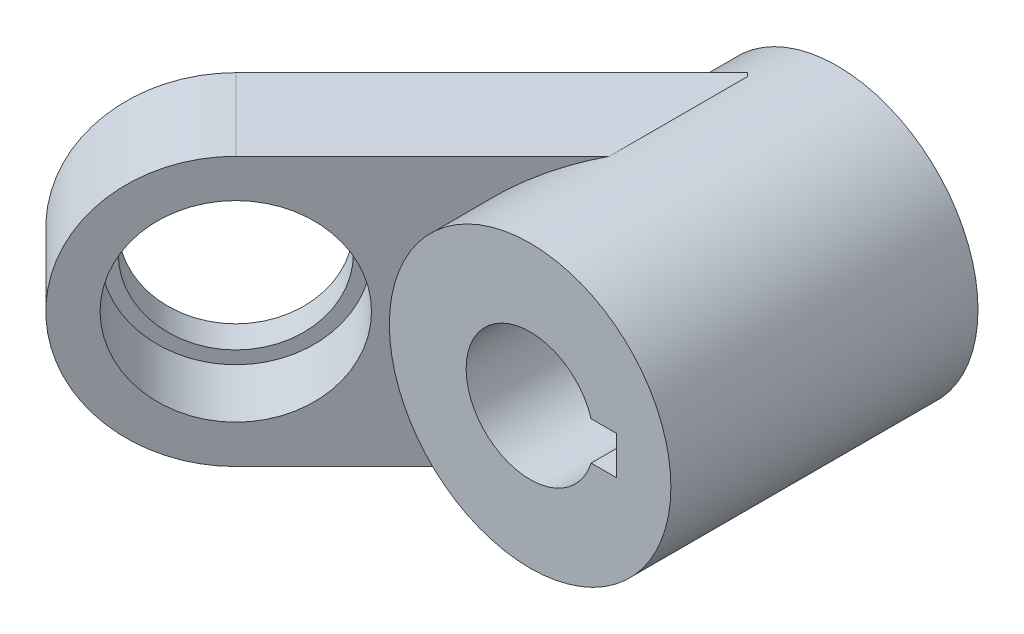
ISO-10303-21;
HEADER;
FILE_DESCRIPTION(('STEP AP214'),'2;1');
FILE_NAME('part.step','',(''),(''),'','','');
FILE_SCHEMA(('AUTOMOTIVE_DESIGN { 1 0 10303 214 1 1 1 1 }'));
ENDSEC;
DATA;
#1=APPLICATION_CONTEXT('core data for automotive mechanical design processes');
#2=APPLICATION_PROTOCOL_DEFINITION('international standard','automotive_design',2000,#1);
#3=PRODUCT_CONTEXT('',#1,'mechanical');
#4=PRODUCT('Part','Part','',(#3));
#5=PRODUCT_RELATED_PRODUCT_CATEGORY('part','',(#4));
#6=PRODUCT_DEFINITION_FORMATION('','',#4);
#7=PRODUCT_DEFINITION_CONTEXT('part definition',#1,'design');
#8=PRODUCT_DEFINITION('design','',#6,#7);
#9=PRODUCT_DEFINITION_SHAPE('','',#8);
#10=(LENGTH_UNIT() NAMED_UNIT(*) SI_UNIT(.MILLI.,.METRE.));
#11=(NAMED_UNIT(*) PLANE_ANGLE_UNIT() SI_UNIT($,.RADIAN.));
#12=(NAMED_UNIT(*) SI_UNIT($,.STERADIAN.) SOLID_ANGLE_UNIT());
#13=UNCERTAINTY_MEASURE_WITH_UNIT(LENGTH_MEASURE(1.E-05),#10,'distance_accuracy_value','');
#14=(GEOMETRIC_REPRESENTATION_CONTEXT(3) GLOBAL_UNCERTAINTY_ASSIGNED_CONTEXT((#13)) GLOBAL_UNIT_ASSIGNED_CONTEXT((#10,
#11,#12)) REPRESENTATION_CONTEXT('',''));
#15=CARTESIAN_POINT('',(0.,0.,0.));
#16=DIRECTION('',(0.,0.,1.));
#17=DIRECTION('',(1.,0.,0.));
#18=AXIS2_PLACEMENT_3D('',#15,#16,#17);
#19=CARTESIAN_POINT('',(0.,0.,48.));
#20=DIRECTION('',(0.,0.,-1.));
#21=DIRECTION('',(-1.,0.,0.));
#22=AXIS2_PLACEMENT_3D('',#19,#20,#21);
#23=CYLINDRICAL_SURFACE('',#22,22.);
#24=CARTESIAN_POINT('',(0.,0.,0.));
#25=DIRECTION('',(0.,0.,1.));
#26=DIRECTION('',(1.,0.,0.));
#27=AXIS2_PLACEMENT_3D('',#24,#25,#26);
#28=CIRCLE('',#27,22.);
#29=CARTESIAN_POINT('',(22.,0.,0.));
#30=VERTEX_POINT('',#29);
#31=EDGE_CURVE('E182',#30,#30,#28,.T.);
#32=ORIENTED_EDGE('',*,*,#31,.T.);
#33=EDGE_LOOP('',(#32));
#34=FACE_BOUND('',#33,.T.);
#35=CARTESIAN_POINT('',(0.,0.,48.));
#36=DIRECTION('',(0.,0.,1.));
#37=DIRECTION('',(1.,0.,0.));
#38=AXIS2_PLACEMENT_3D('',#35,#36,#37);
#39=CIRCLE('',#38,22.);
#40=CARTESIAN_POINT('',(22.,0.,48.));
#41=VERTEX_POINT('',#40);
#42=EDGE_CURVE('E185',#41,#41,#39,.T.);
#43=ORIENTED_EDGE('',*,*,#42,.F.);
#44=EDGE_LOOP('',(#43));
#45=FACE_BOUND('',#44,.T.);
#46=DIRECTION('',(0.,0.,-1.));
#47=VECTOR('',#46,1.);
#48=CARTESIAN_POINT('',(-6.55743852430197,21.,48.));
#49=LINE('',#48,#47);
#50=CARTESIAN_POINT('',(-6.55743852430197,21.,29.0427198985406));
#51=VERTEX_POINT('',#50);
#52=CARTESIAN_POINT('',(-6.55743852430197,21.,7.44256147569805));
#53=VERTEX_POINT('',#52);
#54=EDGE_CURVE('E198',#51,#53,#49,.T.);
#55=ORIENTED_EDGE('',*,*,#54,.F.);
#56=CARTESIAN_POINT('',(0.,0.,22.4852813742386));
#57=DIRECTION('',(-0.707106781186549,0.,-0.707106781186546));
#58=DIRECTION('',(0.707106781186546,0.,-0.707106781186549));
#59=AXIS2_PLACEMENT_3D('',#56,#57,#58);
#60=ELLIPSE('',#59,31.1126983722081,22.);
#61=CARTESIAN_POINT('',(-6.55743852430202,-21.,29.0427198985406));
#62=VERTEX_POINT('',#61);
#63=EDGE_CURVE('E196',#62,#51,#60,.T.);
#64=ORIENTED_EDGE('',*,*,#63,.F.);
#65=DIRECTION('',(0.,0.,-1.));
#66=VECTOR('',#65,1.);
#67=CARTESIAN_POINT('',(-6.55743852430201,-21.,48.));
#68=LINE('',#67,#66);
#69=CARTESIAN_POINT('',(-6.55743852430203,-21.,7.442561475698));
#70=VERTEX_POINT('',#69);
#71=EDGE_CURVE('E194',#70,#62,#68,.F.);
#72=ORIENTED_EDGE('',*,*,#71,.F.);
#73=CARTESIAN_POINT('',(0.,0.,14.));
#74=DIRECTION('',(-0.707106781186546,0.,0.707106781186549));
#75=DIRECTION('',(-0.707106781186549,0.,-0.707106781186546));
#76=AXIS2_PLACEMENT_3D('',#73,#74,#75);
#77=ELLIPSE('',#76,31.112698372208,22.);
#78=CARTESIAN_POINT('',(-7.07106781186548,-20.8326666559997,6.92893218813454));
#79=VERTEX_POINT('',#78);
#80=EDGE_CURVE('E193',#79,#70,#77,.T.);
#81=ORIENTED_EDGE('',*,*,#80,.F.);
#82=CARTESIAN_POINT('',(0.,0.,-0.142135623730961));
#83=DIRECTION('',(-0.707106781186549,0.,-0.707106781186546));
#84=DIRECTION('',(0.707106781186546,0.,-0.707106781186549));
#85=AXIS2_PLACEMENT_3D('',#82,#83,#84);
#86=ELLIPSE('',#85,31.1126983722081,22.);
#87=CARTESIAN_POINT('',(-7.07106781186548,20.8326666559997,6.92893218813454));
#88=VERTEX_POINT('',#87);
#89=EDGE_CURVE('E188',#79,#88,#86,.T.);
#90=ORIENTED_EDGE('',*,*,#89,.T.);
#91=EDGE_CURVE('E191',#53,#88,#77,.T.);
#92=ORIENTED_EDGE('',*,*,#91,.F.);
#93=EDGE_LOOP('',(#55,#64,#72,#81,#90,#92));
#94=FACE_BOUND('',#93,.T.);
#95=ADVANCED_FACE('F30',(#34,#45,#94),#23,.T.);
#96=CARTESIAN_POINT('',(0.,0.,48.));
#97=DIRECTION('',(0.,0.,1.));
#98=DIRECTION('',(1.,0.,0.));
#99=AXIS2_PLACEMENT_3D('',#96,#97,#98);
#100=PLANE('',#99);
#101=DIRECTION('',(1.,0.,0.));
#102=VECTOR('',#101,1.);
#103=CARTESIAN_POINT('',(0.,-3.,48.));
#104=LINE('',#103,#102);
#105=CARTESIAN_POINT('',(9.53939201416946,-3.,48.));
#106=VERTEX_POINT('',#105);
#107=CARTESIAN_POINT('',(13.5,-3.,48.));
#108=VERTEX_POINT('',#107);
#109=EDGE_CURVE('E133',#106,#108,#104,.T.);
#110=ORIENTED_EDGE('',*,*,#109,.F.);
#111=CARTESIAN_POINT('',(0.,0.,48.));
#112=DIRECTION('',(0.,0.,1.));
#113=DIRECTION('',(1.,0.,0.));
#114=AXIS2_PLACEMENT_3D('',#111,#112,#113);
#115=CIRCLE('',#114,10.);
#116=CARTESIAN_POINT('',(9.53939201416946,3.,48.));
#117=VERTEX_POINT('',#116);
#118=EDGE_CURVE('E144',#117,#106,#115,.T.);
#119=ORIENTED_EDGE('',*,*,#118,.F.);
#120=DIRECTION('',(-1.,0.,0.));
#121=VECTOR('',#120,1.);
#122=CARTESIAN_POINT('',(0.,3.,48.));
#123=LINE('',#122,#121);
#124=CARTESIAN_POINT('',(13.5,3.,48.));
#125=VERTEX_POINT('',#124);
#126=EDGE_CURVE('E44',#125,#117,#123,.T.);
#127=ORIENTED_EDGE('',*,*,#126,.F.);
#128=DIRECTION('',(0.,1.,0.));
#129=VECTOR('',#128,1.);
#130=CARTESIAN_POINT('',(13.5,0.,48.));
#131=LINE('',#130,#129);
#132=EDGE_CURVE('E115',#108,#125,#131,.T.);
#133=ORIENTED_EDGE('',*,*,#132,.F.);
#134=EDGE_LOOP('',(#110,#119,#127,#133));
#135=FACE_BOUND('',#134,.T.);
#136=ORIENTED_EDGE('',*,*,#42,.T.);
#137=EDGE_LOOP('',(#136));
#138=FACE_BOUND('',#137,.T.);
#139=ADVANCED_FACE('F208',(#135,#138),#100,.T.);
#140=CARTESIAN_POINT('',(0.,0.,0.));
#141=DIRECTION('',(0.,0.,1.));
#142=DIRECTION('',(1.,0.,0.));
#143=AXIS2_PLACEMENT_3D('',#140,#141,#142);
#144=PLANE('',#143);
#145=CARTESIAN_POINT('',(0.,0.,0.));
#146=DIRECTION('',(0.,0.,-1.));
#147=DIRECTION('',(-1.,0.,0.));
#148=AXIS2_PLACEMENT_3D('',#145,#146,#147);
#149=CIRCLE('',#148,15.);
#150=CARTESIAN_POINT('',(-15.,0.,0.));
#151=VERTEX_POINT('',#150);
#152=EDGE_CURVE('E141',#151,#151,#149,.T.);
#153=ORIENTED_EDGE('',*,*,#152,.F.);
#154=EDGE_LOOP('',(#153));
#155=FACE_BOUND('',#154,.T.);
#156=ORIENTED_EDGE('',*,*,#31,.F.);
#157=EDGE_LOOP('',(#156));
#158=FACE_BOUND('',#157,.T.);
#159=ADVANCED_FACE('F225',(#155,#158),#144,.F.);
#160=CARTESIAN_POINT('',(4.24264068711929,-21.,18.2426406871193));
#161=DIRECTION('',(0.,1.,0.));
#162=DIRECTION('',(0.,0.,1.));
#163=AXIS2_PLACEMENT_3D('',#160,#161,#162);
#164=PLANE('',#163);
#165=DIRECTION('',(-0.707106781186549,0.,-0.707106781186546));
#166=VECTOR('',#165,1.);
#167=CARTESIAN_POINT('',(4.24264068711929,-21.,18.2426406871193));
#168=LINE('',#167,#166);
#169=CARTESIAN_POINT('',(-7.07106781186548,-21.,6.92893218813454));
#170=VERTEX_POINT('',#169);
#171=EDGE_CURVE('E180',#70,#170,#168,.T.);
#172=ORIENTED_EDGE('',*,*,#171,.F.);
#173=ORIENTED_EDGE('',*,*,#71,.T.);
#174=DIRECTION('',(0.707106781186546,0.,-0.707106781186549));
#175=VECTOR('',#174,1.);
#176=CARTESIAN_POINT('',(4.24264068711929,-21.,18.2426406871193));
#177=LINE('',#176,#175);
#178=CARTESIAN_POINT('',(-35.7573593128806,-21.,58.2426406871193));
#179=VERTEX_POINT('',#178);
#180=EDGE_CURVE('E167',#179,#62,#177,.T.);
#181=ORIENTED_EDGE('',*,*,#180,.F.);
#182=DIRECTION('',(-0.707106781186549,0.,-0.707106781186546));
#183=VECTOR('',#182,1.);
#184=CARTESIAN_POINT('',(-35.7573593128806,-21.,58.2426406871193));
#185=LINE('',#184,#183);
#186=CARTESIAN_POINT('',(-47.0710678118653,-21.,46.9289321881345));
#187=VERTEX_POINT('',#186);
#188=EDGE_CURVE('E174',#179,#187,#185,.T.);
#189=ORIENTED_EDGE('',*,*,#188,.T.);
#190=DIRECTION('',(0.707106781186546,0.,-0.707106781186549));
#191=VECTOR('',#190,1.);
#192=CARTESIAN_POINT('',(-7.07106781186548,-21.,6.92893218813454));
#193=LINE('',#192,#191);
#194=EDGE_CURVE('E155',#187,#170,#193,.T.);
#195=ORIENTED_EDGE('',*,*,#194,.T.);
#196=EDGE_LOOP('',(#172,#173,#181,#189,#195));
#197=FACE_BOUND('',#196,.T.);
#198=ADVANCED_FACE('F253',(#197),#164,.F.);
#199=CARTESIAN_POINT('',(4.24264068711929,-21.,18.2426406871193));
#200=DIRECTION('',(-0.707106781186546,0.,0.707106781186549));
#201=DIRECTION('',(0.707106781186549,0.,0.707106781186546));
#202=AXIS2_PLACEMENT_3D('',#199,#200,#201);
#203=PLANE('',#202);
#204=DIRECTION('',(0.,1.,0.));
#205=VECTOR('',#204,1.);
#206=CARTESIAN_POINT('',(-7.07106781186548,-21.,6.92893218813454));
#207=LINE('',#206,#205);
#208=EDGE_CURVE('E158',#170,#79,#207,.T.);
#209=ORIENTED_EDGE('',*,*,#208,.T.);
#210=ORIENTED_EDGE('',*,*,#80,.T.);
#211=ORIENTED_EDGE('',*,*,#171,.T.);
#212=EDGE_LOOP('',(#209,#210,#211));
#213=FACE_BOUND('',#212,.T.);
#214=ADVANCED_FACE('F256',(#213),#203,.F.);
#215=DIRECTION('',(-0.707106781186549,0.,-0.707106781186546));
#216=VECTOR('',#215,1.);
#217=CARTESIAN_POINT('',(4.24264068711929,21.,18.2426406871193));
#218=LINE('',#217,#216);
#219=CARTESIAN_POINT('',(-7.07106781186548,21.,6.92893218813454));
#220=VERTEX_POINT('',#219);
#221=EDGE_CURVE('E178',#53,#220,#218,.T.);
#222=ORIENTED_EDGE('',*,*,#221,.F.);
#223=ORIENTED_EDGE('',*,*,#91,.T.);
#224=EDGE_CURVE('E52',#88,#220,#207,.T.);
#225=ORIENTED_EDGE('',*,*,#224,.T.);
#226=EDGE_LOOP('',(#222,#223,#225));
#227=FACE_BOUND('',#226,.T.);
#228=ADVANCED_FACE('F240',(#227),#203,.F.);
#229=CARTESIAN_POINT('',(4.24264068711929,21.,18.2426406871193));
#230=DIRECTION('',(0.,-1.,0.));
#231=DIRECTION('',(0.,0.,-1.));
#232=AXIS2_PLACEMENT_3D('',#229,#230,#231);
#233=PLANE('',#232);
#234=DIRECTION('',(-0.707106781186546,0.,0.707106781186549));
#235=VECTOR('',#234,1.);
#236=CARTESIAN_POINT('',(4.24264068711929,21.,18.2426406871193));
#237=LINE('',#236,#235);
#238=CARTESIAN_POINT('',(-35.7573593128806,21.,58.2426406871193));
#239=VERTEX_POINT('',#238);
#240=EDGE_CURVE('E170',#51,#239,#237,.T.);
#241=ORIENTED_EDGE('',*,*,#240,.F.);
#242=ORIENTED_EDGE('',*,*,#54,.T.);
#243=ORIENTED_EDGE('',*,*,#221,.T.);
#244=DIRECTION('',(-0.707106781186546,0.,0.707106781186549));
#245=VECTOR('',#244,1.);
#246=CARTESIAN_POINT('',(-7.07106781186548,21.,6.92893218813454));
#247=LINE('',#246,#245);
#248=CARTESIAN_POINT('',(-47.0710678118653,21.,46.9289321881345));
#249=VERTEX_POINT('',#248);
#250=EDGE_CURVE('E161',#220,#249,#247,.T.);
#251=ORIENTED_EDGE('',*,*,#250,.T.);
#252=DIRECTION('',(-0.707106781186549,0.,-0.707106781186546));
#253=VECTOR('',#252,1.);
#254=CARTESIAN_POINT('',(-35.7573593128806,21.,58.2426406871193));
#255=LINE('',#254,#253);
#256=EDGE_CURVE('E176',#239,#249,#255,.T.);
#257=ORIENTED_EDGE('',*,*,#256,.F.);
#258=EDGE_LOOP('',(#241,#242,#243,#251,#257));
#259=FACE_BOUND('',#258,.T.);
#260=ADVANCED_FACE('F237',(#259),#233,.F.);
#261=CARTESIAN_POINT('',(-35.7573593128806,0.,58.2426406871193));
#262=DIRECTION('',(-0.707106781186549,0.,-0.707106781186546));
#263=DIRECTION('',(-0.707106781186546,0.,0.707106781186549));
#264=AXIS2_PLACEMENT_3D('',#261,#262,#263);
#265=PLANE('',#264);
#266=CARTESIAN_POINT('',(-35.7573593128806,0.,58.2426406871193));
#267=DIRECTION('',(0.707106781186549,0.,0.707106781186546));
#268=DIRECTION('',(0.707106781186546,0.,-0.707106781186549));
#269=AXIS2_PLACEMENT_3D('',#266,#267,#268);
#270=CIRCLE('',#269,15.);
#271=CARTESIAN_POINT('',(-25.1507575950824,0.,47.636038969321));
#272=VERTEX_POINT('',#271);
#273=EDGE_CURVE('E145',#272,#272,#270,.T.);
#274=ORIENTED_EDGE('',*,*,#273,.F.);
#275=EDGE_LOOP('',(#274));
#276=FACE_BOUND('',#275,.T.);
#277=ORIENTED_EDGE('',*,*,#180,.T.);
#278=ORIENTED_EDGE('',*,*,#63,.T.);
#279=ORIENTED_EDGE('',*,*,#240,.T.);
#280=CARTESIAN_POINT('',(-35.7573593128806,0.,58.2426406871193));
#281=DIRECTION('',(0.707106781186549,0.,0.707106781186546));
#282=DIRECTION('',(-0.707106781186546,0.,0.707106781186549));
#283=AXIS2_PLACEMENT_3D('',#280,#281,#282);
#284=CIRCLE('',#283,21.);
#285=EDGE_CURVE('E172',#239,#179,#284,.T.);
#286=ORIENTED_EDGE('',*,*,#285,.T.);
#287=EDGE_LOOP('',(#277,#278,#279,#286));
#288=FACE_BOUND('',#287,.T.);
#289=ADVANCED_FACE('F250',(#276,#288),#265,.F.);
#290=CARTESIAN_POINT('',(-47.0710678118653,0.,46.9289321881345));
#291=DIRECTION('',(-0.707106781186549,0.,-0.707106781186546));
#292=DIRECTION('',(-0.707106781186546,0.,0.707106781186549));
#293=AXIS2_PLACEMENT_3D('',#290,#291,#292);
#294=PLANE('',#293);
#295=CARTESIAN_POINT('',(-47.0710678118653,0.,46.9289321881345));
#296=DIRECTION('',(-0.707106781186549,0.,-0.707106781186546));
#297=DIRECTION('',(-0.707106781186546,0.,0.707106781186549));
#298=AXIS2_PLACEMENT_3D('',#295,#296,#297);
#299=CIRCLE('',#298,13.);
#300=CARTESIAN_POINT('',(-56.2634559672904,0.,56.1213203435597));
#301=VERTEX_POINT('',#300);
#302=EDGE_CURVE('E154',#301,#301,#299,.T.);
#303=ORIENTED_EDGE('',*,*,#302,.F.);
#304=EDGE_LOOP('',(#303));
#305=FACE_BOUND('',#304,.T.);
#306=ORIENTED_EDGE('',*,*,#89,.F.);
#307=ORIENTED_EDGE('',*,*,#208,.F.);
#308=ORIENTED_EDGE('',*,*,#194,.F.);
#309=CARTESIAN_POINT('',(-47.0710678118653,0.,46.9289321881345));
#310=DIRECTION('',(0.707106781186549,0.,0.707106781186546));
#311=DIRECTION('',(-0.707106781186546,0.,0.707106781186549));
#312=AXIS2_PLACEMENT_3D('',#309,#310,#311);
#313=CIRCLE('',#312,21.);
#314=EDGE_CURVE('E164',#249,#187,#313,.T.);
#315=ORIENTED_EDGE('',*,*,#314,.F.);
#316=ORIENTED_EDGE('',*,*,#250,.F.);
#317=ORIENTED_EDGE('',*,*,#224,.F.);
#318=EDGE_LOOP('',(#306,#307,#308,#315,#316,#317));
#319=FACE_BOUND('',#318,.T.);
#320=ADVANCED_FACE('F242',(#305,#319),#294,.T.);
#321=CARTESIAN_POINT('',(-35.7573593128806,0.,58.2426406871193));
#322=DIRECTION('',(-0.707106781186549,0.,-0.707106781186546));
#323=DIRECTION('',(-0.707106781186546,0.,0.707106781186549));
#324=AXIS2_PLACEMENT_3D('',#321,#322,#323);
#325=CYLINDRICAL_SURFACE('',#324,21.);
#326=ORIENTED_EDGE('',*,*,#256,.T.);
#327=ORIENTED_EDGE('',*,*,#314,.T.);
#328=ORIENTED_EDGE('',*,*,#188,.F.);
#329=ORIENTED_EDGE('',*,*,#285,.F.);
#330=EDGE_LOOP('',(#326,#327,#328,#329));
#331=FACE_BOUND('',#330,.T.);
#332=ADVANCED_FACE('F247',(#331),#325,.T.);
#333=CARTESIAN_POINT('',(-35.7573593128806,0.,58.2426406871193));
#334=DIRECTION('',(0.707106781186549,0.,0.707106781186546));
#335=DIRECTION('',(0.707106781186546,0.,-0.707106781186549));
#336=AXIS2_PLACEMENT_3D('',#333,#334,#335);
#337=CYLINDRICAL_SURFACE('',#336,13.);
#338=ORIENTED_EDGE('',*,*,#302,.T.);
#339=EDGE_LOOP('',(#338));
#340=FACE_BOUND('',#339,.T.);
#341=CARTESIAN_POINT('',(-43.5355339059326,0.,50.4644660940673));
#342=DIRECTION('',(0.707106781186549,0.,0.707106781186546));
#343=DIRECTION('',(0.707106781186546,0.,-0.707106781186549));
#344=AXIS2_PLACEMENT_3D('',#341,#342,#343);
#345=CIRCLE('',#344,13.);
#346=CARTESIAN_POINT('',(-34.3431457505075,0.,41.2720779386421));
#347=VERTEX_POINT('',#346);
#348=EDGE_CURVE('E151',#347,#347,#345,.T.);
#349=ORIENTED_EDGE('',*,*,#348,.T.);
#350=EDGE_LOOP('',(#349));
#351=FACE_BOUND('',#350,.T.);
#352=ADVANCED_FACE('F292',(#340,#351),#337,.F.);
#353=CARTESIAN_POINT('',(-43.5355339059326,13.,50.4644660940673));
#354=DIRECTION('',(-0.707106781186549,0.,-0.707106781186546));
#355=DIRECTION('',(-0.707106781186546,0.,0.707106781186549));
#356=AXIS2_PLACEMENT_3D('',#353,#354,#355);
#357=PLANE('',#356);
#358=ORIENTED_EDGE('',*,*,#348,.F.);
#359=EDGE_LOOP('',(#358));
#360=FACE_BOUND('',#359,.T.);
#361=CARTESIAN_POINT('',(-43.5355339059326,0.,50.4644660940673));
#362=DIRECTION('',(0.707106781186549,0.,0.707106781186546));
#363=DIRECTION('',(0.707106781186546,0.,-0.707106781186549));
#364=AXIS2_PLACEMENT_3D('',#361,#362,#363);
#365=CIRCLE('',#364,15.);
#366=CARTESIAN_POINT('',(-32.9289321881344,0.,39.857864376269));
#367=VERTEX_POINT('',#366);
#368=EDGE_CURVE('E148',#367,#367,#365,.T.);
#369=ORIENTED_EDGE('',*,*,#368,.T.);
#370=EDGE_LOOP('',(#369));
#371=FACE_BOUND('',#370,.T.);
#372=ADVANCED_FACE('F285',(#360,#371),#357,.F.);
#373=CARTESIAN_POINT('',(-35.7573593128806,0.,58.2426406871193));
#374=DIRECTION('',(0.707106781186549,0.,0.707106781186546));
#375=DIRECTION('',(0.707106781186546,0.,-0.707106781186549));
#376=AXIS2_PLACEMENT_3D('',#373,#374,#375);
#377=CYLINDRICAL_SURFACE('',#376,15.);
#378=ORIENTED_EDGE('',*,*,#368,.F.);
#379=EDGE_LOOP('',(#378));
#380=FACE_BOUND('',#379,.T.);
#381=ORIENTED_EDGE('',*,*,#273,.T.);
#382=EDGE_LOOP('',(#381));
#383=FACE_BOUND('',#382,.T.);
#384=ADVANCED_FACE('F277',(#380,#383),#377,.F.);
#385=CARTESIAN_POINT('',(0.,0.,0.));
#386=DIRECTION('',(0.,0.,-1.));
#387=DIRECTION('',(-1.,0.,0.));
#388=AXIS2_PLACEMENT_3D('',#385,#386,#387);
#389=CYLINDRICAL_SURFACE('',#388,15.);
#390=CARTESIAN_POINT('',(0.,0.,2.));
#391=DIRECTION('',(0.,0.,-1.));
#392=DIRECTION('',(-1.,0.,0.));
#393=AXIS2_PLACEMENT_3D('',#390,#391,#392);
#394=CIRCLE('',#393,15.);
#395=CARTESIAN_POINT('',(-15.,0.,2.));
#396=VERTEX_POINT('',#395);
#397=EDGE_CURVE('E138',#396,#396,#394,.T.);
#398=ORIENTED_EDGE('',*,*,#397,.F.);
#399=EDGE_LOOP('',(#398));
#400=FACE_BOUND('',#399,.T.);
#401=ORIENTED_EDGE('',*,*,#152,.T.);
#402=EDGE_LOOP('',(#401));
#403=FACE_BOUND('',#402,.T.);
#404=ADVANCED_FACE('F275',(#400,#403),#389,.F.);
#405=CARTESIAN_POINT('',(10.,0.,2.));
#406=DIRECTION('',(0.,0.,1.));
#407=DIRECTION('',(1.,0.,0.));
#408=AXIS2_PLACEMENT_3D('',#405,#406,#407);
#409=PLANE('',#408);
#410=CARTESIAN_POINT('',(0.,0.,2.));
#411=DIRECTION('',(0.,0.,-1.));
#412=DIRECTION('',(-1.,0.,0.));
#413=AXIS2_PLACEMENT_3D('',#410,#411,#412);
#414=CIRCLE('',#413,10.);
#415=CARTESIAN_POINT('',(9.53939201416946,-3.,2.));
#416=VERTEX_POINT('',#415);
#417=CARTESIAN_POINT('',(9.53939201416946,3.,2.));
#418=VERTEX_POINT('',#417);
#419=EDGE_CURVE('E136',#416,#418,#414,.T.);
#420=ORIENTED_EDGE('',*,*,#419,.F.);
#421=DIRECTION('',(-1.,0.,0.));
#422=VECTOR('',#421,1.);
#423=CARTESIAN_POINT('',(0.,-3.,2.));
#424=LINE('',#423,#422);
#425=CARTESIAN_POINT('',(13.5,-3.,2.));
#426=VERTEX_POINT('',#425);
#427=EDGE_CURVE('E117',#426,#416,#424,.T.);
#428=ORIENTED_EDGE('',*,*,#427,.F.);
#429=DIRECTION('',(0.,-1.,0.));
#430=VECTOR('',#429,1.);
#431=CARTESIAN_POINT('',(13.5,-3.,2.));
#432=LINE('',#431,#430);
#433=CARTESIAN_POINT('',(13.5,3.,2.));
#434=VERTEX_POINT('',#433);
#435=EDGE_CURVE('E112',#434,#426,#432,.T.);
#436=ORIENTED_EDGE('',*,*,#435,.F.);
#437=DIRECTION('',(1.,0.,0.));
#438=VECTOR('',#437,1.);
#439=CARTESIAN_POINT('',(0.,3.,2.));
#440=LINE('',#439,#438);
#441=EDGE_CURVE('E120',#418,#434,#440,.T.);
#442=ORIENTED_EDGE('',*,*,#441,.F.);
#443=EDGE_LOOP('',(#420,#428,#436,#442));
#444=FACE_BOUND('',#443,.T.);
#445=ORIENTED_EDGE('',*,*,#397,.T.);
#446=EDGE_LOOP('',(#445));
#447=FACE_BOUND('',#446,.T.);
#448=ADVANCED_FACE('F126',(#444,#447),#409,.F.);
#449=CARTESIAN_POINT('',(0.,0.,0.));
#450=DIRECTION('',(0.,0.,-1.));
#451=DIRECTION('',(-1.,0.,0.));
#452=AXIS2_PLACEMENT_3D('',#449,#450,#451);
#453=CYLINDRICAL_SURFACE('',#452,10.);
#454=ORIENTED_EDGE('',*,*,#118,.T.);
#455=DIRECTION('',(0.,0.,-1.));
#456=VECTOR('',#455,1.);
#457=CARTESIAN_POINT('',(9.53939201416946,-3.,0.));
#458=LINE('',#457,#456);
#459=EDGE_CURVE('E11',#106,#416,#458,.T.);
#460=ORIENTED_EDGE('',*,*,#459,.T.);
#461=ORIENTED_EDGE('',*,*,#419,.T.);
#462=DIRECTION('',(0.,0.,-1.));
#463=VECTOR('',#462,1.);
#464=CARTESIAN_POINT('',(9.53939201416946,3.,0.));
#465=LINE('',#464,#463);
#466=EDGE_CURVE('E37',#418,#117,#465,.F.);
#467=ORIENTED_EDGE('',*,*,#466,.T.);
#468=EDGE_LOOP('',(#454,#460,#461,#467));
#469=FACE_BOUND('',#468,.T.);
#470=ADVANCED_FACE('F205',(#469),#453,.F.);
#471=CARTESIAN_POINT('',(0.,-3.,73.0918830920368));
#472=DIRECTION('',(0.,-1.,0.));
#473=DIRECTION('',(1.,0.,0.));
#474=AXIS2_PLACEMENT_3D('',#471,#472,#473);
#475=PLANE('',#474);
#476=ORIENTED_EDGE('',*,*,#109,.T.);
#477=DIRECTION('',(0.,0.,-1.));
#478=VECTOR('',#477,1.);
#479=CARTESIAN_POINT('',(13.5,-3.,73.0918830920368));
#480=LINE('',#479,#478);
#481=EDGE_CURVE('E116',#108,#426,#480,.T.);
#482=ORIENTED_EDGE('',*,*,#481,.T.);
#483=ORIENTED_EDGE('',*,*,#427,.T.);
#484=ORIENTED_EDGE('',*,*,#459,.F.);
#485=EDGE_LOOP('',(#476,#482,#483,#484));
#486=FACE_BOUND('',#485,.T.);
#487=ADVANCED_FACE('F211',(#486),#475,.F.);
#488=CARTESIAN_POINT('',(13.5,-3.,73.0918830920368));
#489=DIRECTION('',(1.,0.,0.));
#490=DIRECTION('',(0.,0.,-1.));
#491=AXIS2_PLACEMENT_3D('',#488,#489,#490);
#492=PLANE('',#491);
#493=ORIENTED_EDGE('',*,*,#132,.T.);
#494=DIRECTION('',(0.,0.,-1.));
#495=VECTOR('',#494,1.);
#496=CARTESIAN_POINT('',(13.5,3.,73.0918830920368));
#497=LINE('',#496,#495);
#498=EDGE_CURVE('E107',#125,#434,#497,.T.);
#499=ORIENTED_EDGE('',*,*,#498,.T.);
#500=ORIENTED_EDGE('',*,*,#435,.T.);
#501=ORIENTED_EDGE('',*,*,#481,.F.);
#502=EDGE_LOOP('',(#493,#499,#500,#501));
#503=FACE_BOUND('',#502,.T.);
#504=ADVANCED_FACE('F109',(#503),#492,.F.);
#505=CARTESIAN_POINT('',(0.,3.,73.0918830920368));
#506=DIRECTION('',(0.,1.,0.));
#507=DIRECTION('',(-1.,0.,0.));
#508=AXIS2_PLACEMENT_3D('',#505,#506,#507);
#509=PLANE('',#508);
#510=ORIENTED_EDGE('',*,*,#126,.T.);
#511=ORIENTED_EDGE('',*,*,#466,.F.);
#512=ORIENTED_EDGE('',*,*,#441,.T.);
#513=ORIENTED_EDGE('',*,*,#498,.F.);
#514=EDGE_LOOP('',(#510,#511,#512,#513));
#515=FACE_BOUND('',#514,.T.);
#516=ADVANCED_FACE('F121',(#515),#509,.F.);
#517=CLOSED_SHELL('',(#95,#139,#159,#198,#214,#228,#260,#289,#320,#332,#352,#372,#384,#404,#448,
#470,#487,#504,#516));
#518=MANIFOLD_SOLID_BREP('B2',#517);
#519=ADVANCED_BREP_SHAPE_REPRESENTATION('',(#18,#518),#14);
#520=SHAPE_DEFINITION_REPRESENTATION(#9,#519);
ENDSEC;
END-ISO-10303-21;
